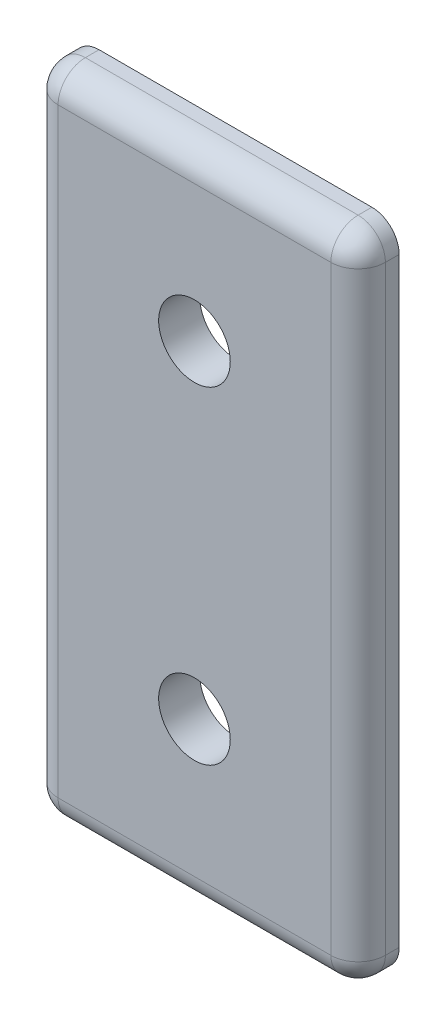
ISO-10303-21;
HEADER;
FILE_DESCRIPTION(('STEP AP214'),'2;1');
FILE_NAME('part.step','',(''),(''),'','','');
FILE_SCHEMA(('AUTOMOTIVE_DESIGN { 1 0 10303 214 1 1 1 1 }'));
ENDSEC;
DATA;
#1=APPLICATION_CONTEXT('core data for automotive mechanical design processes');
#2=APPLICATION_PROTOCOL_DEFINITION('international standard','automotive_design',2000,#1);
#3=PRODUCT_CONTEXT('',#1,'mechanical');
#4=PRODUCT('Part','Part','',(#3));
#5=PRODUCT_RELATED_PRODUCT_CATEGORY('part','',(#4));
#6=PRODUCT_DEFINITION_FORMATION('','',#4);
#7=PRODUCT_DEFINITION_CONTEXT('part definition',#1,'design');
#8=PRODUCT_DEFINITION('design','',#6,#7);
#9=PRODUCT_DEFINITION_SHAPE('','',#8);
#10=(LENGTH_UNIT() NAMED_UNIT(*) SI_UNIT(.MILLI.,.METRE.));
#11=(NAMED_UNIT(*) PLANE_ANGLE_UNIT() SI_UNIT($,.RADIAN.));
#12=(NAMED_UNIT(*) SI_UNIT($,.STERADIAN.) SOLID_ANGLE_UNIT());
#13=UNCERTAINTY_MEASURE_WITH_UNIT(LENGTH_MEASURE(1.E-05),#10,'distance_accuracy_value','');
#14=(GEOMETRIC_REPRESENTATION_CONTEXT(3) GLOBAL_UNCERTAINTY_ASSIGNED_CONTEXT((#13)) GLOBAL_UNIT_ASSIGNED_CONTEXT((#10,
#11,#12)) REPRESENTATION_CONTEXT('',''));
#15=CARTESIAN_POINT('',(0.,0.,0.));
#16=DIRECTION('',(0.,0.,1.));
#17=DIRECTION('',(1.,0.,0.));
#18=AXIS2_PLACEMENT_3D('',#15,#16,#17);
#19=CARTESIAN_POINT('',(-15.875,34.925,4.7752));
#20=DIRECTION('',(0.,0.,1.));
#21=DIRECTION('',(1.,0.,0.));
#22=AXIS2_PLACEMENT_3D('',#19,#20,#21);
#23=PLANE('',#22);
#24=DIRECTION('',(-1.,0.,0.));
#25=VECTOR('',#24,1.);
#26=CARTESIAN_POINT('',(-15.875,34.925,4.7752));
#27=LINE('',#26,#25);
#28=CARTESIAN_POINT('',(15.875,34.925,4.7752));
#29=VERTEX_POINT('',#28);
#30=CARTESIAN_POINT('',(-15.875,34.925,4.7752));
#31=VERTEX_POINT('',#30);
#32=EDGE_CURVE('E488',#29,#31,#27,.T.);
#33=ORIENTED_EDGE('',*,*,#32,.T.);
#34=DIRECTION('',(0.,-1.,0.));
#35=VECTOR('',#34,1.);
#36=CARTESIAN_POINT('',(-15.875,-34.925,4.7752));
#37=LINE('',#36,#35);
#38=CARTESIAN_POINT('',(-15.875,-34.925,4.7752));
#39=VERTEX_POINT('',#38);
#40=EDGE_CURVE('E494',#31,#39,#37,.T.);
#41=ORIENTED_EDGE('',*,*,#40,.T.);
#42=DIRECTION('',(1.,0.,0.));
#43=VECTOR('',#42,1.);
#44=CARTESIAN_POINT('',(15.875,-34.925,4.7752));
#45=LINE('',#44,#43);
#46=CARTESIAN_POINT('',(15.875,-34.925,4.7752));
#47=VERTEX_POINT('',#46);
#48=EDGE_CURVE('E492',#39,#47,#45,.T.);
#49=ORIENTED_EDGE('',*,*,#48,.T.);
#50=DIRECTION('',(0.,1.,0.));
#51=VECTOR('',#50,1.);
#52=CARTESIAN_POINT('',(15.875,34.925,4.7752));
#53=LINE('',#52,#51);
#54=EDGE_CURVE('E490',#47,#29,#53,.T.);
#55=ORIENTED_EDGE('',*,*,#54,.T.);
#56=EDGE_LOOP('',(#33,#41,#49,#55));
#57=FACE_BOUND('',#56,.T.);
#58=CARTESIAN_POINT('',(0.,19.05,4.7752));
#59=DIRECTION('',(0.,0.,1.));
#60=DIRECTION('',(1.,0.,0.));
#61=AXIS2_PLACEMENT_3D('',#58,#59,#60);
#62=CIRCLE('',#61,4.1671875);
#63=CARTESIAN_POINT('',(4.1671875,19.05,4.7752));
#64=VERTEX_POINT('',#63);
#65=EDGE_CURVE('E453',#64,#64,#62,.T.);
#66=ORIENTED_EDGE('',*,*,#65,.F.);
#67=EDGE_LOOP('',(#66));
#68=FACE_BOUND('',#67,.T.);
#69=CARTESIAN_POINT('',(0.,-19.05,4.7752));
#70=DIRECTION('',(0.,0.,1.));
#71=DIRECTION('',(1.,0.,0.));
#72=AXIS2_PLACEMENT_3D('',#69,#70,#71);
#73=CIRCLE('',#72,4.1671875);
#74=CARTESIAN_POINT('',(4.1671875,-19.05,4.7752));
#75=VERTEX_POINT('',#74);
#76=EDGE_CURVE('E532',#75,#75,#73,.T.);
#77=ORIENTED_EDGE('',*,*,#76,.F.);
#78=EDGE_LOOP('',(#77));
#79=FACE_BOUND('',#78,.T.);
#80=ADVANCED_FACE('F351',(#57,#68,#79),#23,.T.);
#81=CARTESIAN_POINT('',(-15.875,34.925,0.));
#82=DIRECTION('',(0.,0.,1.));
#83=DIRECTION('',(1.,0.,0.));
#84=AXIS2_PLACEMENT_3D('',#81,#82,#83);
#85=PLANE('',#84);
#86=CARTESIAN_POINT('',(0.,19.05,0.));
#87=DIRECTION('',(0.,0.,1.));
#88=DIRECTION('',(1.,0.,0.));
#89=AXIS2_PLACEMENT_3D('',#86,#87,#88);
#90=CIRCLE('',#89,4.1671875);
#91=CARTESIAN_POINT('',(4.1671875,19.05,0.));
#92=VERTEX_POINT('',#91);
#93=EDGE_CURVE('E456',#92,#92,#90,.T.);
#94=ORIENTED_EDGE('',*,*,#93,.T.);
#95=EDGE_LOOP('',(#94));
#96=FACE_BOUND('',#95,.T.);
#97=CARTESIAN_POINT('',(-15.875,34.925,0.));
#98=DIRECTION('',(0.,0.,1.));
#99=DIRECTION('',(1.,0.,0.));
#100=AXIS2_PLACEMENT_3D('',#97,#98,#99);
#101=CIRCLE('',#100,3.175);
#102=CARTESIAN_POINT('',(-15.875,38.1,0.));
#103=VERTEX_POINT('',#102);
#104=CARTESIAN_POINT('',(-19.05,34.925,0.));
#105=VERTEX_POINT('',#104);
#106=EDGE_CURVE('E446',#103,#105,#101,.T.);
#107=ORIENTED_EDGE('',*,*,#106,.F.);
#108=DIRECTION('',(-1.,0.,0.));
#109=VECTOR('',#108,1.);
#110=CARTESIAN_POINT('',(-15.875,38.1,0.));
#111=LINE('',#110,#109);
#112=CARTESIAN_POINT('',(15.875,38.1,0.));
#113=VERTEX_POINT('',#112);
#114=EDGE_CURVE('E473',#113,#103,#111,.T.);
#115=ORIENTED_EDGE('',*,*,#114,.F.);
#116=CARTESIAN_POINT('',(15.875,34.925,0.));
#117=DIRECTION('',(0.,0.,1.));
#118=DIRECTION('',(-1.,0.,0.));
#119=AXIS2_PLACEMENT_3D('',#116,#117,#118);
#120=CIRCLE('',#119,3.175);
#121=CARTESIAN_POINT('',(19.05,34.925,0.));
#122=VERTEX_POINT('',#121);
#123=EDGE_CURVE('E470',#122,#113,#120,.T.);
#124=ORIENTED_EDGE('',*,*,#123,.F.);
#125=DIRECTION('',(0.,1.,0.));
#126=VECTOR('',#125,1.);
#127=CARTESIAN_POINT('',(19.05,34.925,0.));
#128=LINE('',#127,#126);
#129=CARTESIAN_POINT('',(19.05,-34.925,0.));
#130=VERTEX_POINT('',#129);
#131=EDGE_CURVE('E467',#130,#122,#128,.T.);
#132=ORIENTED_EDGE('',*,*,#131,.F.);
#133=CARTESIAN_POINT('',(15.875,-34.925,0.));
#134=DIRECTION('',(0.,0.,1.));
#135=DIRECTION('',(1.,0.,0.));
#136=AXIS2_PLACEMENT_3D('',#133,#134,#135);
#137=CIRCLE('',#136,3.175);
#138=CARTESIAN_POINT('',(15.875,-38.1,0.));
#139=VERTEX_POINT('',#138);
#140=EDGE_CURVE('E464',#139,#130,#137,.T.);
#141=ORIENTED_EDGE('',*,*,#140,.F.);
#142=DIRECTION('',(1.,0.,0.));
#143=VECTOR('',#142,1.);
#144=CARTESIAN_POINT('',(-15.875,-38.1,0.));
#145=LINE('',#144,#143);
#146=CARTESIAN_POINT('',(-15.875,-38.1,0.));
#147=VERTEX_POINT('',#146);
#148=EDGE_CURVE('E461',#147,#139,#145,.T.);
#149=ORIENTED_EDGE('',*,*,#148,.F.);
#150=CARTESIAN_POINT('',(-15.875,-34.925,0.));
#151=DIRECTION('',(0.,0.,1.));
#152=DIRECTION('',(1.,0.,0.));
#153=AXIS2_PLACEMENT_3D('',#150,#151,#152);
#154=CIRCLE('',#153,3.175);
#155=CARTESIAN_POINT('',(-19.05,-34.925,0.));
#156=VERTEX_POINT('',#155);
#157=EDGE_CURVE('E449',#156,#147,#154,.T.);
#158=ORIENTED_EDGE('',*,*,#157,.F.);
#159=DIRECTION('',(0.,-1.,0.));
#160=VECTOR('',#159,1.);
#161=CARTESIAN_POINT('',(-19.05,34.925,0.));
#162=LINE('',#161,#160);
#163=EDGE_CURVE('E430',#105,#156,#162,.T.);
#164=ORIENTED_EDGE('',*,*,#163,.F.);
#165=EDGE_LOOP('',(#107,#115,#124,#132,#141,#149,#158,#164));
#166=FACE_BOUND('',#165,.T.);
#167=CARTESIAN_POINT('',(0.,-19.05,0.));
#168=DIRECTION('',(0.,0.,1.));
#169=DIRECTION('',(1.,0.,0.));
#170=AXIS2_PLACEMENT_3D('',#167,#168,#169);
#171=CIRCLE('',#170,4.1671875);
#172=CARTESIAN_POINT('',(4.1671875,-19.05,0.));
#173=VERTEX_POINT('',#172);
#174=EDGE_CURVE('E529',#173,#173,#171,.T.);
#175=ORIENTED_EDGE('',*,*,#174,.T.);
#176=EDGE_LOOP('',(#175));
#177=FACE_BOUND('',#176,.T.);
#178=ADVANCED_FACE('F443',(#96,#166,#177),#85,.F.);
#179=CARTESIAN_POINT('',(-15.875,34.925,4.7752));
#180=DIRECTION('',(0.,0.,-1.));
#181=DIRECTION('',(-1.,0.,0.));
#182=AXIS2_PLACEMENT_3D('',#179,#180,#181);
#183=CYLINDRICAL_SURFACE('',#182,3.175);
#184=DIRECTION('',(0.,0.,-1.));
#185=VECTOR('',#184,1.);
#186=CARTESIAN_POINT('',(-19.05,34.925,4.7752));
#187=LINE('',#186,#185);
#188=CARTESIAN_POINT('',(-19.05,34.925,1.6002));
#189=VERTEX_POINT('',#188);
#190=EDGE_CURVE('E426',#189,#105,#187,.T.);
#191=ORIENTED_EDGE('',*,*,#190,.F.);
#192=CARTESIAN_POINT('',(-15.875,34.925,1.6002));
#193=DIRECTION('',(0.,0.,-1.));
#194=DIRECTION('',(-1.,0.,0.));
#195=AXIS2_PLACEMENT_3D('',#192,#193,#194);
#196=CIRCLE('',#195,3.175);
#197=CARTESIAN_POINT('',(-15.875,38.1,1.6002));
#198=VERTEX_POINT('',#197);
#199=EDGE_CURVE('E438',#189,#198,#196,.T.);
#200=ORIENTED_EDGE('',*,*,#199,.T.);
#201=DIRECTION('',(0.,0.,-1.));
#202=VECTOR('',#201,1.);
#203=CARTESIAN_POINT('',(-15.875,38.1,4.7752));
#204=LINE('',#203,#202);
#205=EDGE_CURVE('E451',#198,#103,#204,.T.);
#206=ORIENTED_EDGE('',*,*,#205,.T.);
#207=ORIENTED_EDGE('',*,*,#106,.T.);
#208=EDGE_LOOP('',(#191,#200,#206,#207));
#209=FACE_BOUND('',#208,.T.);
#210=ADVANCED_FACE('F353',(#209),#183,.T.);
#211=CARTESIAN_POINT('',(-19.05,34.925,4.7752));
#212=DIRECTION('',(1.,0.,0.));
#213=DIRECTION('',(0.,0.,-1.));
#214=AXIS2_PLACEMENT_3D('',#211,#212,#213);
#215=PLANE('',#214);
#216=DIRECTION('',(0.,0.,-1.));
#217=VECTOR('',#216,1.);
#218=CARTESIAN_POINT('',(-19.05,-34.925,4.7752));
#219=LINE('',#218,#217);
#220=CARTESIAN_POINT('',(-19.05,-34.925,1.6002));
#221=VERTEX_POINT('',#220);
#222=EDGE_CURVE('E439',#221,#156,#219,.T.);
#223=ORIENTED_EDGE('',*,*,#222,.F.);
#224=DIRECTION('',(0.,-1.,0.));
#225=VECTOR('',#224,1.);
#226=CARTESIAN_POINT('',(-19.05,34.925,1.6002));
#227=LINE('',#226,#225);
#228=EDGE_CURVE('E433',#221,#189,#227,.F.);
#229=ORIENTED_EDGE('',*,*,#228,.T.);
#230=ORIENTED_EDGE('',*,*,#190,.T.);
#231=ORIENTED_EDGE('',*,*,#163,.T.);
#232=EDGE_LOOP('',(#223,#229,#230,#231));
#233=FACE_BOUND('',#232,.T.);
#234=ADVANCED_FACE('F429',(#233),#215,.F.);
#235=CARTESIAN_POINT('',(-15.875,-34.925,4.7752));
#236=DIRECTION('',(0.,0.,-1.));
#237=DIRECTION('',(-1.,0.,0.));
#238=AXIS2_PLACEMENT_3D('',#235,#236,#237);
#239=CYLINDRICAL_SURFACE('',#238,3.175);
#240=DIRECTION('',(0.,0.,-1.));
#241=VECTOR('',#240,1.);
#242=CARTESIAN_POINT('',(-15.875,-38.1,4.7752));
#243=LINE('',#242,#241);
#244=CARTESIAN_POINT('',(-15.875,-38.1,1.6002));
#245=VERTEX_POINT('',#244);
#246=EDGE_CURVE('E484',#245,#147,#243,.T.);
#247=ORIENTED_EDGE('',*,*,#246,.F.);
#248=CARTESIAN_POINT('',(-15.875,-34.925,1.6002));
#249=DIRECTION('',(0.,0.,-1.));
#250=DIRECTION('',(-1.,0.,0.));
#251=AXIS2_PLACEMENT_3D('',#248,#249,#250);
#252=CIRCLE('',#251,3.175);
#253=EDGE_CURVE('E498',#245,#221,#252,.T.);
#254=ORIENTED_EDGE('',*,*,#253,.T.);
#255=ORIENTED_EDGE('',*,*,#222,.T.);
#256=ORIENTED_EDGE('',*,*,#157,.T.);
#257=EDGE_LOOP('',(#247,#254,#255,#256));
#258=FACE_BOUND('',#257,.T.);
#259=ADVANCED_FACE('F576',(#258),#239,.T.);
#260=CARTESIAN_POINT('',(-15.875,-38.1,4.7752));
#261=DIRECTION('',(0.,1.,0.));
#262=DIRECTION('',(0.,0.,1.));
#263=AXIS2_PLACEMENT_3D('',#260,#261,#262);
#264=PLANE('',#263);
#265=DIRECTION('',(0.,0.,-1.));
#266=VECTOR('',#265,1.);
#267=CARTESIAN_POINT('',(15.875,-38.1,4.7752));
#268=LINE('',#267,#266);
#269=CARTESIAN_POINT('',(15.875,-38.1,1.6002));
#270=VERTEX_POINT('',#269);
#271=EDGE_CURVE('E482',#270,#139,#268,.T.);
#272=ORIENTED_EDGE('',*,*,#271,.F.);
#273=DIRECTION('',(1.,0.,0.));
#274=VECTOR('',#273,1.);
#275=CARTESIAN_POINT('',(-15.875,-38.1,1.6002));
#276=LINE('',#275,#274);
#277=EDGE_CURVE('E500',#270,#245,#276,.F.);
#278=ORIENTED_EDGE('',*,*,#277,.T.);
#279=ORIENTED_EDGE('',*,*,#246,.T.);
#280=ORIENTED_EDGE('',*,*,#148,.T.);
#281=EDGE_LOOP('',(#272,#278,#279,#280));
#282=FACE_BOUND('',#281,.T.);
#283=ADVANCED_FACE('F573',(#282),#264,.F.);
#284=CARTESIAN_POINT('',(15.875,-34.925,4.7752));
#285=DIRECTION('',(0.,0.,-1.));
#286=DIRECTION('',(-1.,0.,0.));
#287=AXIS2_PLACEMENT_3D('',#284,#285,#286);
#288=CYLINDRICAL_SURFACE('',#287,3.175);
#289=DIRECTION('',(0.,0.,-1.));
#290=VECTOR('',#289,1.);
#291=CARTESIAN_POINT('',(19.05,-34.925,4.7752));
#292=LINE('',#291,#290);
#293=CARTESIAN_POINT('',(19.05,-34.925,1.6002));
#294=VERTEX_POINT('',#293);
#295=EDGE_CURVE('E480',#294,#130,#292,.T.);
#296=ORIENTED_EDGE('',*,*,#295,.F.);
#297=CARTESIAN_POINT('',(15.875,-34.925,1.6002));
#298=DIRECTION('',(0.,0.,-1.));
#299=DIRECTION('',(-1.,0.,0.));
#300=AXIS2_PLACEMENT_3D('',#297,#298,#299);
#301=CIRCLE('',#300,3.175);
#302=EDGE_CURVE('E502',#294,#270,#301,.T.);
#303=ORIENTED_EDGE('',*,*,#302,.T.);
#304=ORIENTED_EDGE('',*,*,#271,.T.);
#305=ORIENTED_EDGE('',*,*,#140,.T.);
#306=EDGE_LOOP('',(#296,#303,#304,#305));
#307=FACE_BOUND('',#306,.T.);
#308=ADVANCED_FACE('F515',(#307),#288,.T.);
#309=CARTESIAN_POINT('',(19.05,34.925,4.7752));
#310=DIRECTION('',(-1.,0.,0.));
#311=DIRECTION('',(0.,0.,1.));
#312=AXIS2_PLACEMENT_3D('',#309,#310,#311);
#313=PLANE('',#312);
#314=DIRECTION('',(0.,0.,-1.));
#315=VECTOR('',#314,1.);
#316=CARTESIAN_POINT('',(19.05,34.925,4.7752));
#317=LINE('',#316,#315);
#318=CARTESIAN_POINT('',(19.05,34.925,1.6002));
#319=VERTEX_POINT('',#318);
#320=EDGE_CURVE('E478',#319,#122,#317,.T.);
#321=ORIENTED_EDGE('',*,*,#320,.F.);
#322=DIRECTION('',(0.,1.,0.));
#323=VECTOR('',#322,1.);
#324=CARTESIAN_POINT('',(19.05,-34.925,1.6002));
#325=LINE('',#324,#323);
#326=EDGE_CURVE('E504',#319,#294,#325,.F.);
#327=ORIENTED_EDGE('',*,*,#326,.T.);
#328=ORIENTED_EDGE('',*,*,#295,.T.);
#329=ORIENTED_EDGE('',*,*,#131,.T.);
#330=EDGE_LOOP('',(#321,#327,#328,#329));
#331=FACE_BOUND('',#330,.T.);
#332=ADVANCED_FACE('F508',(#331),#313,.F.);
#333=CARTESIAN_POINT('',(15.875,34.925,4.7752));
#334=DIRECTION('',(0.,0.,-1.));
#335=DIRECTION('',(-1.,0.,0.));
#336=AXIS2_PLACEMENT_3D('',#333,#334,#335);
#337=CYLINDRICAL_SURFACE('',#336,3.175);
#338=DIRECTION('',(0.,0.,-1.));
#339=VECTOR('',#338,1.);
#340=CARTESIAN_POINT('',(15.875,38.1,4.7752));
#341=LINE('',#340,#339);
#342=CARTESIAN_POINT('',(15.875,38.1,1.6002));
#343=VERTEX_POINT('',#342);
#344=EDGE_CURVE('E476',#343,#113,#341,.T.);
#345=ORIENTED_EDGE('',*,*,#344,.F.);
#346=CARTESIAN_POINT('',(15.875,34.925,1.6002));
#347=DIRECTION('',(0.,0.,-1.));
#348=DIRECTION('',(-1.,0.,0.));
#349=AXIS2_PLACEMENT_3D('',#346,#347,#348);
#350=CIRCLE('',#349,3.175);
#351=EDGE_CURVE('E359',#343,#319,#350,.T.);
#352=ORIENTED_EDGE('',*,*,#351,.T.);
#353=ORIENTED_EDGE('',*,*,#320,.T.);
#354=ORIENTED_EDGE('',*,*,#123,.T.);
#355=EDGE_LOOP('',(#345,#352,#353,#354));
#356=FACE_BOUND('',#355,.T.);
#357=ADVANCED_FACE('F556',(#356),#337,.T.);
#358=CARTESIAN_POINT('',(-15.875,38.1,4.7752));
#359=DIRECTION('',(0.,-1.,0.));
#360=DIRECTION('',(0.,0.,-1.));
#361=AXIS2_PLACEMENT_3D('',#358,#359,#360);
#362=PLANE('',#361);
#363=ORIENTED_EDGE('',*,*,#205,.F.);
#364=DIRECTION('',(-1.,0.,0.));
#365=VECTOR('',#364,1.);
#366=CARTESIAN_POINT('',(15.875,38.1,1.6002));
#367=LINE('',#366,#365);
#368=EDGE_CURVE('E11',#198,#343,#367,.F.);
#369=ORIENTED_EDGE('',*,*,#368,.T.);
#370=ORIENTED_EDGE('',*,*,#344,.T.);
#371=ORIENTED_EDGE('',*,*,#114,.T.);
#372=EDGE_LOOP('',(#363,#369,#370,#371));
#373=FACE_BOUND('',#372,.T.);
#374=ADVANCED_FACE('F546',(#373),#362,.F.);
#375=CARTESIAN_POINT('',(0.,19.05,4.7752));
#376=DIRECTION('',(0.,0.,-1.));
#377=DIRECTION('',(-1.,0.,0.));
#378=AXIS2_PLACEMENT_3D('',#375,#376,#377);
#379=CYLINDRICAL_SURFACE('',#378,4.1671875);
#380=ORIENTED_EDGE('',*,*,#65,.T.);
#381=EDGE_LOOP('',(#380));
#382=FACE_BOUND('',#381,.T.);
#383=ORIENTED_EDGE('',*,*,#93,.F.);
#384=EDGE_LOOP('',(#383));
#385=FACE_BOUND('',#384,.T.);
#386=ADVANCED_FACE('F543',(#382,#385),#379,.F.);
#387=CARTESIAN_POINT('',(0.,-19.05,4.7752));
#388=DIRECTION('',(0.,0.,-1.));
#389=DIRECTION('',(-1.,0.,0.));
#390=AXIS2_PLACEMENT_3D('',#387,#388,#389);
#391=CYLINDRICAL_SURFACE('',#390,4.1671875);
#392=ORIENTED_EDGE('',*,*,#76,.T.);
#393=EDGE_LOOP('',(#392));
#394=FACE_BOUND('',#393,.T.);
#395=ORIENTED_EDGE('',*,*,#174,.F.);
#396=EDGE_LOOP('',(#395));
#397=FACE_BOUND('',#396,.T.);
#398=ADVANCED_FACE('F545',(#394,#397),#391,.F.);
#399=CARTESIAN_POINT('',(15.875,-34.925,1.6002));
#400=DIRECTION('',(0.,0.,1.));
#401=DIRECTION('',(1.,0.,0.));
#402=AXIS2_PLACEMENT_3D('',#399,#400,#401);
#403=SPHERICAL_SURFACE('',#402,3.175);
#404=CARTESIAN_POINT('',(15.875,-34.925,1.6002));
#405=DIRECTION('',(-1.,0.,0.));
#406=DIRECTION('',(0.,0.,1.));
#407=AXIS2_PLACEMENT_3D('',#404,#405,#406);
#408=CIRCLE('',#407,3.175);
#409=EDGE_CURVE('E526',#270,#47,#408,.T.);
#410=ORIENTED_EDGE('',*,*,#409,.F.);
#411=ORIENTED_EDGE('',*,*,#302,.F.);
#412=CARTESIAN_POINT('',(15.875,-34.925,1.6002));
#413=DIRECTION('',(0.,1.,0.));
#414=DIRECTION('',(0.,0.,1.));
#415=AXIS2_PLACEMENT_3D('',#412,#413,#414);
#416=CIRCLE('',#415,3.175);
#417=EDGE_CURVE('E523',#47,#294,#416,.T.);
#418=ORIENTED_EDGE('',*,*,#417,.F.);
#419=EDGE_LOOP('',(#410,#411,#418));
#420=FACE_BOUND('',#419,.T.);
#421=ADVANCED_FACE('F522',(#420),#403,.T.);
#422=CARTESIAN_POINT('',(15.875,34.925,1.6002));
#423=DIRECTION('',(0.,-1.,0.));
#424=DIRECTION('',(0.,0.,-1.));
#425=AXIS2_PLACEMENT_3D('',#422,#423,#424);
#426=CYLINDRICAL_SURFACE('',#425,3.175);
#427=ORIENTED_EDGE('',*,*,#417,.T.);
#428=ORIENTED_EDGE('',*,*,#326,.F.);
#429=CARTESIAN_POINT('',(15.875,34.925,1.6002));
#430=DIRECTION('',(0.,1.,0.));
#431=DIRECTION('',(0.,0.,1.));
#432=AXIS2_PLACEMENT_3D('',#429,#430,#431);
#433=CIRCLE('',#432,3.175);
#434=EDGE_CURVE('E534',#29,#319,#433,.T.);
#435=ORIENTED_EDGE('',*,*,#434,.F.);
#436=ORIENTED_EDGE('',*,*,#54,.F.);
#437=EDGE_LOOP('',(#427,#428,#435,#436));
#438=FACE_BOUND('',#437,.T.);
#439=ADVANCED_FACE('F528',(#438),#426,.T.);
#440=CARTESIAN_POINT('',(-15.875,-34.925,1.6002));
#441=DIRECTION('',(-1.,0.,0.));
#442=DIRECTION('',(0.,0.,1.));
#443=AXIS2_PLACEMENT_3D('',#440,#441,#442);
#444=CYLINDRICAL_SURFACE('',#443,3.175);
#445=ORIENTED_EDGE('',*,*,#409,.T.);
#446=ORIENTED_EDGE('',*,*,#48,.F.);
#447=CARTESIAN_POINT('',(-15.875,-34.925,1.6002));
#448=DIRECTION('',(-1.,0.,0.));
#449=DIRECTION('',(0.,0.,1.));
#450=AXIS2_PLACEMENT_3D('',#447,#448,#449);
#451=CIRCLE('',#450,3.175);
#452=EDGE_CURVE('E694',#245,#39,#451,.T.);
#453=ORIENTED_EDGE('',*,*,#452,.F.);
#454=ORIENTED_EDGE('',*,*,#277,.F.);
#455=EDGE_LOOP('',(#445,#446,#453,#454));
#456=FACE_BOUND('',#455,.T.);
#457=ADVANCED_FACE('F633',(#456),#444,.T.);
#458=CARTESIAN_POINT('',(15.875,34.925,1.6002));
#459=DIRECTION('',(0.,0.,1.));
#460=DIRECTION('',(1.,0.,0.));
#461=AXIS2_PLACEMENT_3D('',#458,#459,#460);
#462=SPHERICAL_SURFACE('',#461,3.175);
#463=ORIENTED_EDGE('',*,*,#434,.T.);
#464=ORIENTED_EDGE('',*,*,#351,.F.);
#465=CARTESIAN_POINT('',(15.875,34.925,1.6002));
#466=DIRECTION('',(-1.,0.,0.));
#467=DIRECTION('',(0.,0.,1.));
#468=AXIS2_PLACEMENT_3D('',#465,#466,#467);
#469=CIRCLE('',#468,3.175);
#470=EDGE_CURVE('E692',#29,#343,#469,.T.);
#471=ORIENTED_EDGE('',*,*,#470,.F.);
#472=EDGE_LOOP('',(#463,#464,#471));
#473=FACE_BOUND('',#472,.T.);
#474=ADVANCED_FACE('F640',(#473),#462,.T.);
#475=CARTESIAN_POINT('',(-15.875,-34.925,1.6002));
#476=DIRECTION('',(0.,0.,1.));
#477=DIRECTION('',(1.,0.,0.));
#478=AXIS2_PLACEMENT_3D('',#475,#476,#477);
#479=SPHERICAL_SURFACE('',#478,3.175);
#480=ORIENTED_EDGE('',*,*,#253,.F.);
#481=ORIENTED_EDGE('',*,*,#452,.T.);
#482=CARTESIAN_POINT('',(-15.875,-34.925,1.6002));
#483=DIRECTION('',(0.,1.,0.));
#484=DIRECTION('',(0.,0.,1.));
#485=AXIS2_PLACEMENT_3D('',#482,#483,#484);
#486=CIRCLE('',#485,3.175);
#487=EDGE_CURVE('E688',#221,#39,#486,.T.);
#488=ORIENTED_EDGE('',*,*,#487,.F.);
#489=EDGE_LOOP('',(#480,#481,#488));
#490=FACE_BOUND('',#489,.T.);
#491=ADVANCED_FACE('F648',(#490),#479,.T.);
#492=CARTESIAN_POINT('',(-15.875,34.925,1.6002));
#493=DIRECTION('',(1.,0.,0.));
#494=DIRECTION('',(0.,0.,-1.));
#495=AXIS2_PLACEMENT_3D('',#492,#493,#494);
#496=CYLINDRICAL_SURFACE('',#495,3.175);
#497=ORIENTED_EDGE('',*,*,#470,.T.);
#498=ORIENTED_EDGE('',*,*,#368,.F.);
#499=CARTESIAN_POINT('',(-15.875,34.925,1.6002));
#500=DIRECTION('',(-1.,0.,0.));
#501=DIRECTION('',(0.,0.,1.));
#502=AXIS2_PLACEMENT_3D('',#499,#500,#501);
#503=CIRCLE('',#502,3.175);
#504=EDGE_CURVE('E684',#31,#198,#503,.T.);
#505=ORIENTED_EDGE('',*,*,#504,.F.);
#506=ORIENTED_EDGE('',*,*,#32,.F.);
#507=EDGE_LOOP('',(#497,#498,#505,#506));
#508=FACE_BOUND('',#507,.T.);
#509=ADVANCED_FACE('F656',(#508),#496,.T.);
#510=CARTESIAN_POINT('',(-15.875,34.925,1.6002));
#511=DIRECTION('',(0.,1.,0.));
#512=DIRECTION('',(0.,0.,1.));
#513=AXIS2_PLACEMENT_3D('',#510,#511,#512);
#514=CYLINDRICAL_SURFACE('',#513,3.175);
#515=ORIENTED_EDGE('',*,*,#487,.T.);
#516=ORIENTED_EDGE('',*,*,#40,.F.);
#517=CARTESIAN_POINT('',(-15.875,34.925,1.6002));
#518=DIRECTION('',(0.,1.,0.));
#519=DIRECTION('',(0.,0.,1.));
#520=AXIS2_PLACEMENT_3D('',#517,#518,#519);
#521=CIRCLE('',#520,3.175);
#522=EDGE_CURVE('E686',#189,#31,#521,.T.);
#523=ORIENTED_EDGE('',*,*,#522,.F.);
#524=ORIENTED_EDGE('',*,*,#228,.F.);
#525=EDGE_LOOP('',(#515,#516,#523,#524));
#526=FACE_BOUND('',#525,.T.);
#527=ADVANCED_FACE('F664',(#526),#514,.T.);
#528=CARTESIAN_POINT('',(-15.875,34.925,1.6002));
#529=DIRECTION('',(0.,0.,1.));
#530=DIRECTION('',(1.,0.,0.));
#531=AXIS2_PLACEMENT_3D('',#528,#529,#530);
#532=SPHERICAL_SURFACE('',#531,3.175);
#533=ORIENTED_EDGE('',*,*,#504,.T.);
#534=ORIENTED_EDGE('',*,*,#199,.F.);
#535=ORIENTED_EDGE('',*,*,#522,.T.);
#536=EDGE_LOOP('',(#533,#534,#535));
#537=FACE_BOUND('',#536,.T.);
#538=ADVANCED_FACE('F672',(#537),#532,.T.);
#539=CLOSED_SHELL('',(#80,#178,#210,#234,#259,#283,#308,#332,#357,#374,#386,#398,#421,#439,#457,
#474,#491,#509,#527,#538));
#540=MANIFOLD_SOLID_BREP('B2',#539);
#541=ADVANCED_BREP_SHAPE_REPRESENTATION('',(#18,#540),#14);
#542=SHAPE_DEFINITION_REPRESENTATION(#9,#541);
ENDSEC;
END-ISO-10303-21;
